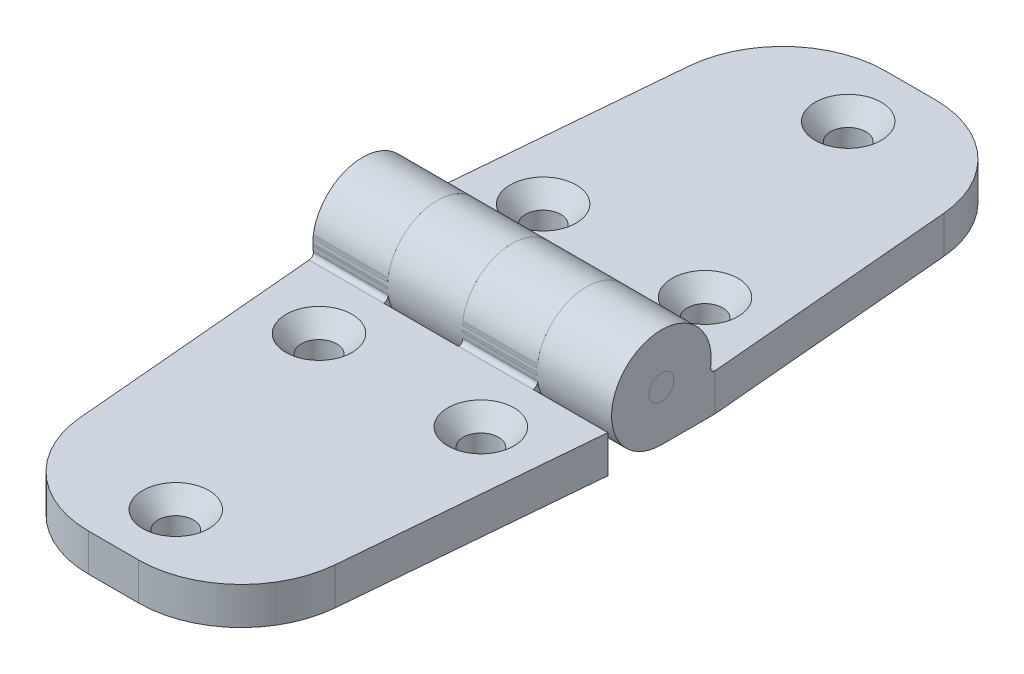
from build123d import *

# Parameters (mm, degrees)
SKETCH2_R                                     = 1.5875
EXTRUDE1_DEPTH                                = 19.05
SKETCH24_W                                    = 9.525
SKETCH24_H                                    = 13.174082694
CUT_EXTRUDE5_DEPTH                            = 56.72102386
EXTRUDE2_REACH                                = 57.721
SKETCH4_R                                     = 1.5875
EXTRUDE2_DIRECTION_2_REACH                    = 57.721
SKETCH25_W                                    = 9.525
SKETCH25_H                                    = 13.102238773
CUT_EXTRUDE6_DEPTH                            = 56.72102386
SKETCH7_W                                     = 38.1
SKETCH7_H                                     = 1.5875
CUT_EXTRUDE4_DEPTH                            = 1056.132
CSK_FOR_8_FLAT_HEAD_MACHINE_SCREW1_AT_2_COUNT = 2
CSK_FOR_8_FLAT_HEAD_MACHINE_SCREW1_AT_2_PITCH = 30.381033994
CSK_FOR_8_FLAT_HEAD_MACHINE_SCREW1_AT_3_COUNT = 2
CSK_FOR_8_FLAT_HEAD_MACHINE_SCREW1_AT_3_PITCH = 30.381033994
CSK_FOR_8_FLAT_HEAD_MACHINE_SCREW1_AT_4_COUNT = 2
CSK_FOR_8_FLAT_HEAD_MACHINE_SCREW1_AT_4_PITCH = 58.074082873
CSK_FOR_8_FLAT_HEAD_MACHINE_SCREW1_AT_5_COUNT = 2
CSK_FOR_8_FLAT_HEAD_MACHINE_SCREW1_AT_5_PITCH = 58.074082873
CSK_FOR_8_FLAT_HEAD_MACHINE_SCREW1_AT_6_COUNT = 2
CSK_FOR_8_FLAT_HEAD_MACHINE_SCREW1_AT_6_PITCH = 85.725


with BuildPart() as part:
    # Sketch2 → Extrude1 (new, symmetric)
    with BuildSketch(Plane(origin=(0, 0, 0), x_dir=(0, 0, -1), z_dir=(1, 0, 0))):
        with BuildLine():
            Line((0, 0), (-50.8, 0))
            Line((-50.8, 0), (-50.8, 4.7625))
            Line((-50.8, 4.7625), (-6.824082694, 4.7625))
            ThreePointArc((-6.824082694, 4.7625), (-6.405376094, 4.954700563), (-6.278156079, 5.3975))
            ThreePointArc((-6.278156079, 5.3975), (4.139693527, 11.165125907), (0, 0))
        make_face()
        with Locations(Location((0, 6.35, 0), (0, 0, 180))):
            Circle(SKETCH2_R, mode=Mode.SUBTRACT)
    extrude(amount=EXTRUDE1_DEPTH, both=True)

    # Sketch24 → Cut-Extrude5 (cut, through all)
    with BuildSketch(Plane(origin=(0, 0, 0), x_dir=(1, 0, 0), z_dir=(0, 1, 0))):
        with Locations((-4.7625, -0.237041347)):
            Rectangle(SKETCH24_W, SKETCH24_H)
        with Locations((14.2875, -0.237041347)):
            Rectangle(SKETCH24_W, SKETCH24_H)
    extrude(amount=CUT_EXTRUDE5_DEPTH, mode=Mode.SUBTRACT)


with BuildPart() as body_2:

    # Extrude2: up to this face of the body (flat: up to its plane)
    extrude2_end = Plane(part.part.faces().sort_by_distance((19.05, 2.38125, 28.812041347))[0])
    # Sketch4 → Extrude2 (new, up to the picked face)
    with BuildSketch(Plane(origin=(0, 0, 0), x_dir=(0, 0, -1), z_dir=(1, 0, 0)), mode=Mode.PRIVATE) as extrude2_sk1:
        with BuildLine():
            Line((0, 0), (50.8, 0))
            Line((50.8, 0), (50.8, 4.7625))
            Line((50.8, 4.7625), (6.824082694, 4.7625))
            ThreePointArc((6.824082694, 4.7625), (6.405376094, 4.954700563), (6.278156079, 5.3975))
            ThreePointArc((6.278156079, 5.3975), (-4.139693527, 11.165125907), (0, 0))
        make_face()
        with Locations((0, 6.35)):
            Circle(SKETCH4_R, mode=Mode.SUBTRACT)
    extrude2_tool1 = split(extrude(extrude2_sk1.sketch, amount=EXTRUDE2_REACH, mode=Mode.PRIVATE), bisect_by=extrude2_end, keep=Keep.BOTH, mode=Mode.PRIVATE)
    add(extrude2_tool1.solids().sort_by(Axis((0, 3.746489, -17.964559), (1, 0, 0)))[0])


    # Extrude2 direction 2: up to this face of the body (flat: up to its plane)
    extrude2_direction_2_end = Plane(part.part.faces().sort_by_distance((-19.05, 3.746489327, 17.964559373))[0])
    # Sketch4 → Extrude2 direction 2 (add, up to the picked face)
    with BuildSketch(Plane(origin=(0, 0, 0), x_dir=(0, 0, -1), z_dir=(1, 0, 0)), mode=Mode.PRIVATE) as extrude2_direction_2_sk1:
        with BuildLine():
            Line((0, 0), (50.8, 0))
            Line((50.8, 0), (50.8, 4.7625))
            Line((50.8, 4.7625), (6.824082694, 4.7625))
            ThreePointArc((6.824082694, 4.7625), (6.405376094, 4.954700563), (6.278156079, 5.3975))
            ThreePointArc((6.278156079, 5.3975), (-4.139693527, 11.165125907), (0, 0))
        make_face()
        with Locations((0, 6.35)):
            Circle(SKETCH4_R, mode=Mode.SUBTRACT)
    extrude2_direction_2_tool1 = split(extrude(extrude2_direction_2_sk1.sketch, amount=-EXTRUDE2_DIRECTION_2_REACH, mode=Mode.PRIVATE), bisect_by=extrude2_direction_2_end, keep=Keep.BOTH, mode=Mode.PRIVATE)
    add(extrude2_direction_2_tool1.solids().sort_by(Axis((0, 3.746489, -17.964559), (-1, 0, 0)))[0])

    # Sketch25 → Cut-Extrude6 (cut, through all)
    with BuildSketch(Plane(origin=(0, 0, 0), x_dir=(1, 0, 0), z_dir=(0, 1, 0))):
        with Locations((-14.2875, 0.272963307)):
            Rectangle(SKETCH25_W, SKETCH25_H)
        with Locations((4.7625, 0.272963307)):
            Rectangle(SKETCH25_W, SKETCH25_H)
    extrude(amount=CUT_EXTRUDE6_DEPTH, mode=Mode.SUBTRACT)


with BuildPart() as body_3:
    # Sketch7 → Revolve1 (revolve)
    with BuildSketch(Plane(origin=(0, 6.35, 0), x_dir=(-1, 0, 0), z_dir=(0, 1, 0)), mode=Mode.PRIVATE) as revolve1_sk:
        with Locations((0, -0.79375)):
            Rectangle(SKETCH7_W, SKETCH7_H)
    revolve(revolve1_sk.sketch.rotate(Axis((19.05, 6.35, 0), (-1, 0, 0)), 180), axis=Axis((19.05, 6.35, 0), (-1, 0, 0)))


with BuildPart() as cut_extrude4_tool:
    # Sketch8 → Cut-Extrude4 (new body)
    with BuildSketch(Plane(origin=(0, 4.7625, 0), x_dir=(-1, 0, 0), z_dir=(0, 1, 0))):
        with BuildLine():
            Line((-19.05, -6.824082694), (-16.250880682, -38.818162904))
            ThreePointArc((-16.250880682, -38.818162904), (-12.042681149, -47.3515474), (-3.175, -50.8))
            Line((-3.175, -50.8), (3.175, -50.8))
            ThreePointArc((3.175, -50.8), (12.042681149, -47.3515474), (16.250880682, -38.818162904))
            Line((16.250880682, -38.818162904), (19.05, -6.824082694))
            Line((19.05, -6.824082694), (22.119129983, -6.824082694))
            Line((22.119129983, -6.824082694), (22.119129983, -53.464086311))
            Line((22.119129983, -53.464086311), (-22.119129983, -53.464086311))
            Line((-22.119129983, -53.464086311), (-22.119129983, -6.824082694))
            Line((-22.119129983, -6.824082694), (-19.05, -6.824082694))
        make_face()
        with BuildLine():
            Line((3.175, 50.8), (-3.175, 50.8))
            ThreePointArc((-3.175, 50.8), (-12.042681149, 47.3515474), (-16.250880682, 38.818162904))
            Line((-16.250880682, 38.818162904), (-19.05, 6.824082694))
            Line((-19.05, 6.824082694), (-22.119129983, 6.824082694))
            Line((-22.119129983, 6.824082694), (-22.119129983, 53.464086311))
            Line((-22.119129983, 53.464086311), (22.119129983, 53.464086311))
            Line((22.119129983, 53.464086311), (22.119129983, 6.824082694))
            Line((22.119129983, 6.824082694), (19.05, 6.824082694))
            Line((19.05, 6.824082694), (16.250880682, 38.818162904))
            ThreePointArc((16.250880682, 38.818162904), (12.042681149, 47.3515474), (3.175, 50.8))
        make_face()
    extrude(amount=-CUT_EXTRUDE4_DEPTH)


with BuildPart() as part_1:
    add(part.part)

    # Cut-Extrude4: cut by cut_extrude4_tool
    add(cut_extrude4_tool.part, mode=Mode.SUBTRACT)


with BuildPart() as body_2_1:
    add(body_2.part)

    # Cut-Extrude4: cut by cut_extrude4_tool
    add(cut_extrude4_tool.part, mode=Mode.SUBTRACT)

    # Sketch13 → CSK for _8 Flat Head Machine Screw1 (revolve, cut)
    with BuildSketch(Plane(origin=(0, 4.7625, -42.8625), x_dir=(0, 0, 1), z_dir=(1, 0, 0))):
        Polygon((0, 0), (0, 4.7625), (2.2479, 4.7625), (2.2479, 2.26450021), (4.2164, 0), align=None)
    csk_for_8_flat_head_machine_screw1 = revolve(axis=Axis((0, 11.1125, -42.8625), (0, -1, 0)), mode=Mode.SUBTRACT)

    # CSK for _8 Flat Head Machine Screw1 at 2: CSK for _8 Flat Head Machine Screw1 ×2
    with Locations(*[Vector(-0.3396444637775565, 0, 0.9405538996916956) * (i * CSK_FOR_8_FLAT_HEAD_MACHINE_SCREW1_AT_2_PITCH) for i in range(1, CSK_FOR_8_FLAT_HEAD_MACHINE_SCREW1_AT_2_COUNT)]):
        add(csk_for_8_flat_head_machine_screw1, mode=Mode.SUBTRACT)

    # CSK for _8 Flat Head Machine Screw1 at 3: CSK for _8 Flat Head Machine Screw1 ×2
    with Locations(*[Vector(0.33964446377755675, 0, 0.9405538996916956) * (i * CSK_FOR_8_FLAT_HEAD_MACHINE_SCREW1_AT_3_PITCH) for i in range(1, CSK_FOR_8_FLAT_HEAD_MACHINE_SCREW1_AT_3_COUNT)]):
        add(csk_for_8_flat_head_machine_screw1, mode=Mode.SUBTRACT)


with BuildPart() as part_2:
    add(part_1.part)

    # CSK for _8 Flat Head Machine Screw1 at 4: CSK for _8 Flat Head Machine Screw1 ×2
    with Locations(*[Vector(-0.17768253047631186, 0, 0.984087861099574) * (i * CSK_FOR_8_FLAT_HEAD_MACHINE_SCREW1_AT_4_PITCH) for i in range(1, CSK_FOR_8_FLAT_HEAD_MACHINE_SCREW1_AT_4_COUNT)]):
        add(csk_for_8_flat_head_machine_screw1, mode=Mode.SUBTRACT)

    # CSK for _8 Flat Head Machine Screw1 at 5: CSK for _8 Flat Head Machine Screw1 ×2
    with Locations(*[Vector(0.17768253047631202, 0, 0.984087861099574) * (i * CSK_FOR_8_FLAT_HEAD_MACHINE_SCREW1_AT_5_PITCH) for i in range(1, CSK_FOR_8_FLAT_HEAD_MACHINE_SCREW1_AT_5_COUNT)]):
        add(csk_for_8_flat_head_machine_screw1, mode=Mode.SUBTRACT)

    # CSK for _8 Flat Head Machine Screw1 at 6: CSK for _8 Flat Head Machine Screw1 ×2
    with Locations(*[(0, 0, i * CSK_FOR_8_FLAT_HEAD_MACHINE_SCREW1_AT_6_PITCH) for i in range(1, CSK_FOR_8_FLAT_HEAD_MACHINE_SCREW1_AT_6_COUNT)]):
        add(csk_for_8_flat_head_machine_screw1, mode=Mode.SUBTRACT)


solid = Compound([body_3.part, body_2_1.part, part_2.part])
